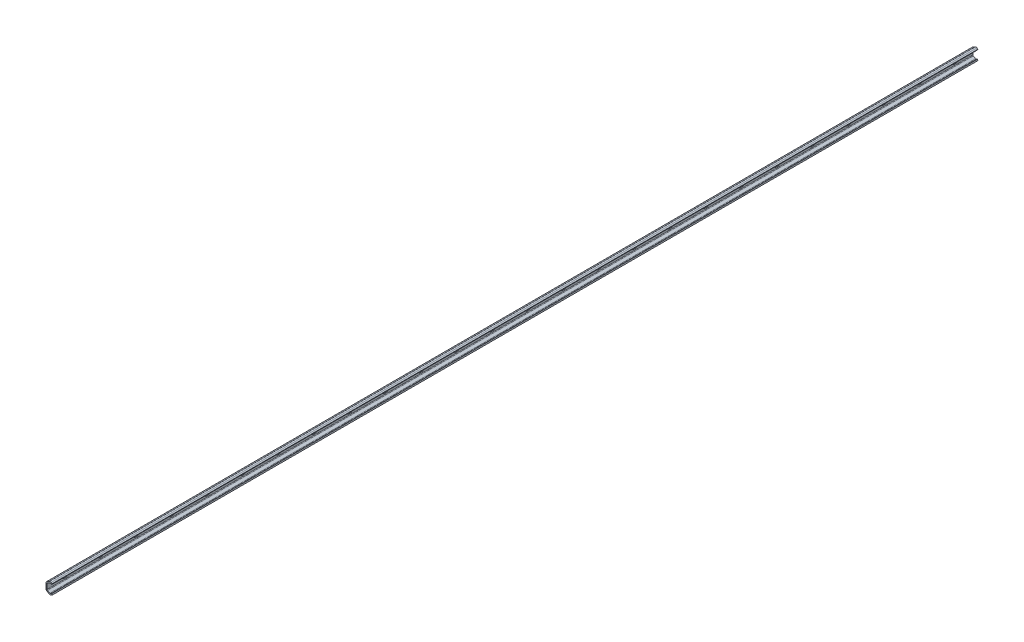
from build123d import *

# Parameters (mm, degrees)
BOSS_EXTRUDE1_DEPTH = 2080
CUT_EXTRUDE1_DEPTH  = 2081.072614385
LPATTERN1_COUNT     = 26
LPATTERN1_PITCH     = 80


with BuildPart() as part:
    # Sketch1 → Boss-Extrude1 (new body)
    with BuildSketch(Plane.XY):
        with BuildLine():
            Line((12.749875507, 8.887652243), (13.999952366, 11.052754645))
            Line((13.999952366, 11.052754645), (11.499977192, 12.496178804))
            ThreePointArc((11.499977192, 12.496178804), (9.499867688, 13.03212673), (7.499758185, 12.496178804))
            Line((7.499758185, 12.496178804), (1.999934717, 9.320716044))
            ThreePointArc((1.999934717, 9.320716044), (0.535879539, 7.85661948), (0, 5.856652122))
            Line((0, 5.856652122), (0, -5.856652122))
            ThreePointArc((0, -5.856652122), (0.535879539, -7.85661948), (1.999934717, -9.320716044))
            Line((1.999934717, -9.320716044), (7.499758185, -12.496178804))
            ThreePointArc((7.499758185, -12.496178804), (9.499867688, -13.03212673), (11.499977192, -12.496178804))
            Line((11.499977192, -12.496178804), (13.999952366, -11.052754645))
            Line((13.999952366, -11.052754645), (12.749875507, -8.887652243))
            Line((12.749875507, -8.887652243), (10.49990033, -10.186732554))
            ThreePointArc((10.49990033, -10.186732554), (9.499867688, -10.454700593), (8.499835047, -10.186732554))
            Line((8.499835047, -10.186732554), (3.500146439, -7.300035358))
            ThreePointArc((3.500146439, -7.300035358), (2.76811885, -6.567987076), (2.500179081, -5.568003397))
            Line((2.500179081, -5.568003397), (2.500179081, 0))
            Line((2.500179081, 0), (2.500179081, 5.568003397))
            ThreePointArc((2.500179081, 5.568003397), (2.76811885, 6.567987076), (3.500146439, 7.300035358))
            Line((3.500146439, 7.300035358), (8.499835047, 10.186732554))
            ThreePointArc((8.499835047, 10.186732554), (9.499867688, 10.454700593), (10.49990033, 10.186732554))
            Line((10.49990033, 10.186732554), (12.749875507, 8.887652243))
        make_face()
    extrude(amount=-BOSS_EXTRUDE1_DEPTH)

    # Sketch2 → Cut-Extrude1 (cut, through all)
    with BuildSketch(Plane(origin=(2.500179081, 0, 0), x_dir=(0, 0, -1), z_dir=(1, 0, 0))):
        with BuildLine():
            Line((37.5, 3), (42.5, 3))
            ThreePointArc((42.5, 3), (45.5, 0), (42.5, -3))
            Line((42.5, -3), (37.5, -3))
            ThreePointArc((37.5, -3), (34.5, 0), (37.5, 3))
        make_face()
    cut_extrude1 = extrude(amount=-CUT_EXTRUDE1_DEPTH, mode=Mode.SUBTRACT)

    # LPattern1: Cut-Extrude1 ×26
    with Locations(*[(0, 0, -i * LPATTERN1_PITCH) for i in range(1, LPATTERN1_COUNT)]):
        add(cut_extrude1, mode=Mode.SUBTRACT)


solid = part.part
